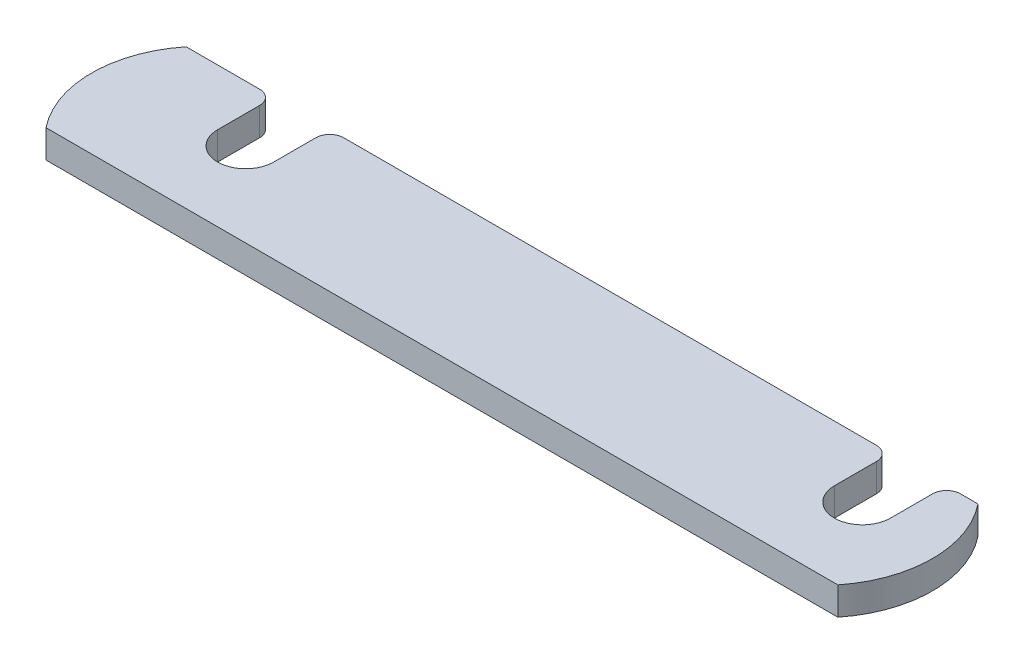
from build123d import *

# Parameters (mm, degrees)
RESSALTO_EXTRUS_O2_DEPTH = 2


with BuildPart() as part:
    # Esbo_o1 → Ressalto-extrus_o2 (new body)
    with BuildSketch(Plane(origin=(0, 0, 0), x_dir=(1, 0, 0), z_dir=(0, 1, 0))):
        with BuildLine():
            Line((-28.244997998, 5), (-23, 5))
            ThreePointArc((-23, 5), (-22.292893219, 4.707106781), (-22, 4))
            Line((-22, 4), (-22, 1))
            ThreePointArc((-22, 1), (-20, -1), (-18, 1))
            Line((-18, 1), (-18, 4))
            ThreePointArc((-18, 4), (-17.707106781, 4.707106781), (-17, 5))
            Line((-17, 5), (21, 5))
            ThreePointArc((21, 5), (21.707106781, 4.707106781), (22, 4))
            Line((22, 4), (22, 1))
            ThreePointArc((22, 1), (24, -1), (26, 1))
            Line((26, 1), (26, 4))
            ThreePointArc((26, 4), (26.292893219, 4.707106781), (27, 5))
            Line((27, 5), (28.244997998, 5))
            ThreePointArc((28.244997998, 5), (30, 0), (28.244997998, -5))
            Line((28.244997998, -5), (-28.244997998, -5))
            ThreePointArc((-28.244997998, -5), (-30, 0), (-28.244997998, 5))
        make_face()
    extrude(amount=RESSALTO_EXTRUS_O2_DEPTH)


solid = part.part
